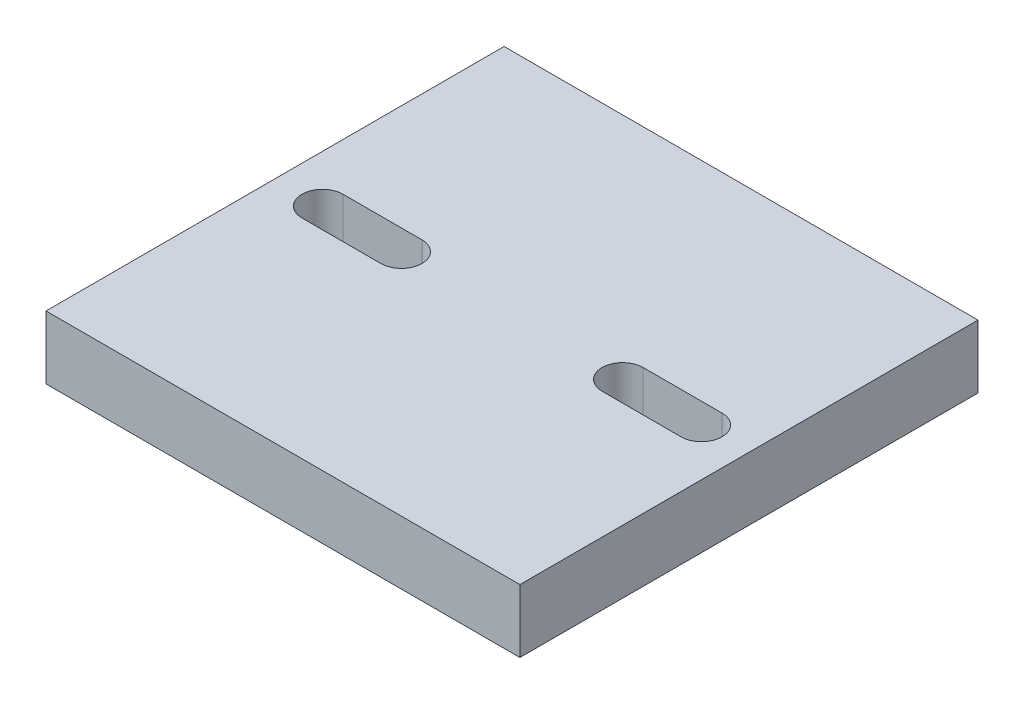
from build123d import *

# Parameters (mm, degrees)
SKETCH_2_W          = 60
SKETCH_2_H          = 8
EXTRUDE_2_DEPTH     = 58
CUT_EXTRUDE_1_DEPTH = 84.833167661


with BuildPart() as part:
    # Sketch 2 → Extrude 2 (new body)
    with BuildSketch(Plane.XY):
        with Locations((-30, 4)):
            Rectangle(SKETCH_2_W, SKETCH_2_H)
    extrude(amount=EXTRUDE_2_DEPTH)

    # Sketch 3 → Cut-Extrude 1 (cut, through all)
    with BuildSketch(Plane(origin=(0, 8, 0), x_dir=(1, 0, 0), z_dir=(0, 1, 0))):
        with BuildLine():
            Line((-54, -26.4), (-44, -26.4))
            ThreePointArc((-44, -26.4), (-41.4, -29), (-44, -31.6))
            Line((-44, -31.6), (-54, -31.6))
            ThreePointArc((-54, -31.6), (-56.6, -29), (-54, -26.4))
        make_face()
        with BuildLine():
            Line((-6, -31.6), (-16, -31.6))
            ThreePointArc((-16, -31.6), (-18.6, -29), (-16, -26.4))
            Line((-16, -26.4), (-6, -26.4))
            ThreePointArc((-6, -26.4), (-3.4, -29), (-6, -31.6))
        make_face()
    extrude(amount=-CUT_EXTRUDE_1_DEPTH, mode=Mode.SUBTRACT)


solid = part.part
